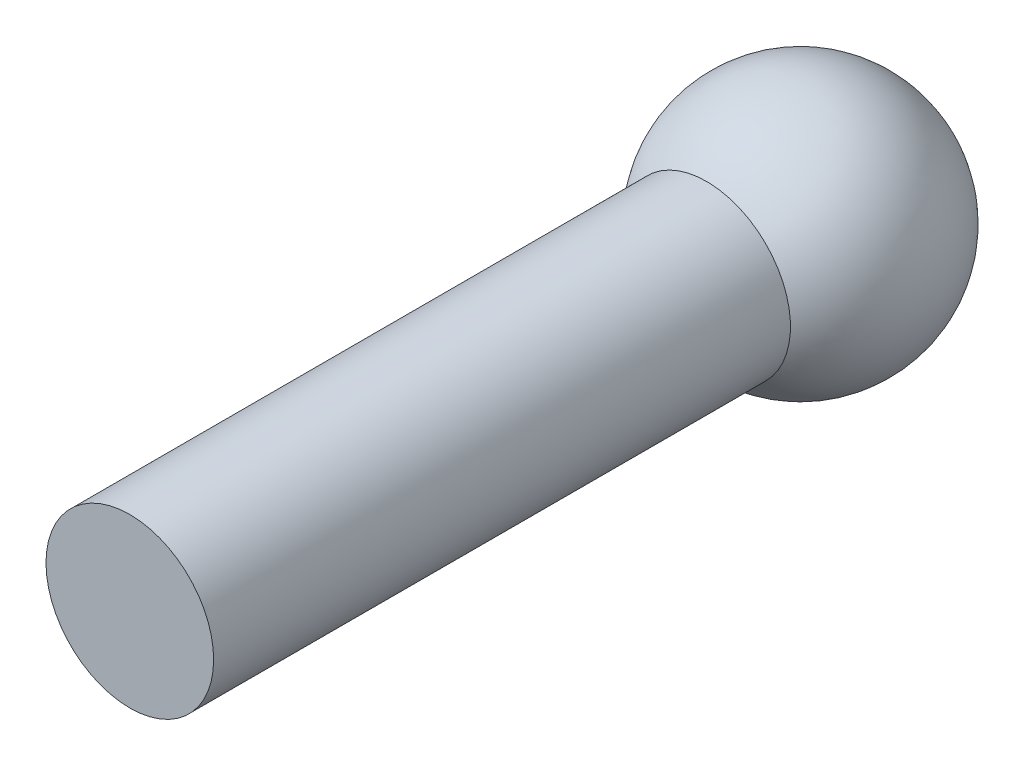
from build123d import *

# Parameters (mm, degrees)
ESQUISSE1_R        = 0.5
BOSS_EXTRU_1_DEPTH = 4


with BuildPart() as part:
    # Esquisse1 → Boss.-Extru.1 (new body)
    with BuildSketch(Plane.XY):
        Circle(ESQUISSE1_R)
    extrude(amount=BOSS_EXTRU_1_DEPTH)

    # Esquisse2 → R_volution1 (revolve)
    with BuildSketch(Plane(origin=(0, 0, 0), x_dir=(-1, 0, 0), z_dir=(0, 0, -1))):
        with BuildLine():
            Line((0, 0.75), (0, -0.75))
            ThreePointArc((0, -0.75), (0.75, 0), (0, 0.75))
        make_face()
    revolve(axis=Axis((0, 0.75, 0), (0, -1, 0)))


solid = part.part
